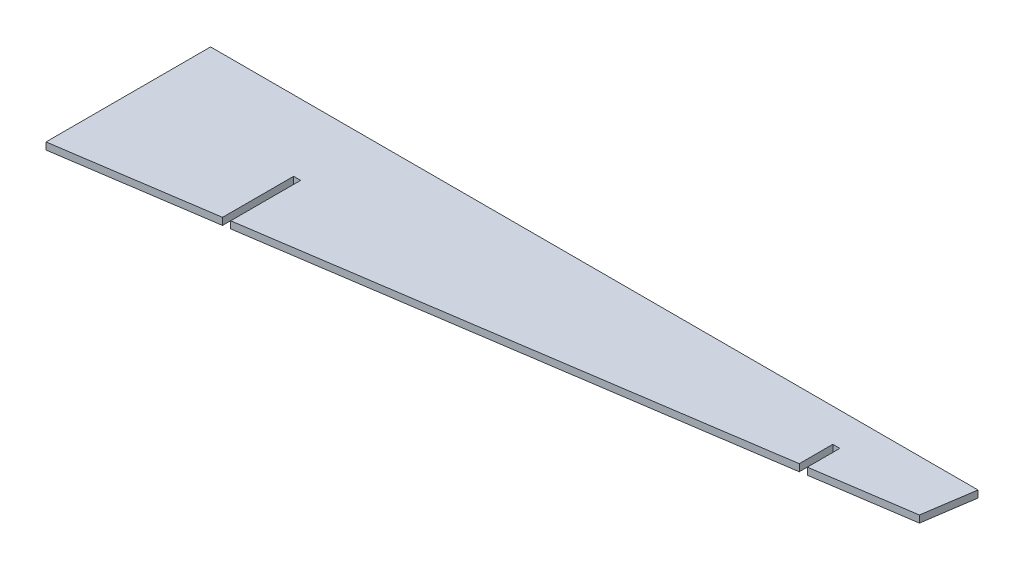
ISO-10303-21;
HEADER;
FILE_DESCRIPTION(('STEP AP214'),'2;1');
FILE_NAME('part.step','',(''),(''),'','','');
FILE_SCHEMA(('AUTOMOTIVE_DESIGN { 1 0 10303 214 1 1 1 1 }'));
ENDSEC;
DATA;
#1=APPLICATION_CONTEXT('core data for automotive mechanical design processes');
#2=APPLICATION_PROTOCOL_DEFINITION('international standard','automotive_design',2000,#1);
#3=PRODUCT_CONTEXT('',#1,'mechanical');
#4=PRODUCT('Part','Part','',(#3));
#5=PRODUCT_RELATED_PRODUCT_CATEGORY('part','',(#4));
#6=PRODUCT_DEFINITION_FORMATION('','',#4);
#7=PRODUCT_DEFINITION_CONTEXT('part definition',#1,'design');
#8=PRODUCT_DEFINITION('design','',#6,#7);
#9=PRODUCT_DEFINITION_SHAPE('','',#8);
#10=(LENGTH_UNIT() NAMED_UNIT(*) SI_UNIT(.MILLI.,.METRE.));
#11=(NAMED_UNIT(*) PLANE_ANGLE_UNIT() SI_UNIT($,.RADIAN.));
#12=(NAMED_UNIT(*) SI_UNIT($,.STERADIAN.) SOLID_ANGLE_UNIT());
#13=UNCERTAINTY_MEASURE_WITH_UNIT(LENGTH_MEASURE(1.E-05),#10,'distance_accuracy_value','');
#14=(GEOMETRIC_REPRESENTATION_CONTEXT(3) GLOBAL_UNCERTAINTY_ASSIGNED_CONTEXT((#13)) GLOBAL_UNIT_ASSIGNED_CONTEXT((#10,
#11,#12)) REPRESENTATION_CONTEXT('',''));
#15=CARTESIAN_POINT('',(0.,0.,0.));
#16=DIRECTION('',(0.,0.,1.));
#17=DIRECTION('',(1.,0.,0.));
#18=AXIS2_PLACEMENT_3D('',#15,#16,#17);
#19=CARTESIAN_POINT('',(984.716974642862,-825.896874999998,57.5474232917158));
#20=DIRECTION('',(-0.147902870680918,0.,-0.989001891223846));
#21=DIRECTION('',(-0.989001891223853,0.,0.147902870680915));
#22=AXIS2_PLACEMENT_3D('',#19,#20,#21);
#23=PLANE('',#22);
#24=DIRECTION('',(0.989001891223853,0.,-0.147902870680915));
#25=VECTOR('',#24,1.);
#26=CARTESIAN_POINT('',(-128.795659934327,-825.896874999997,224.07057825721));
#27=LINE('',#26,#25);
#28=CARTESIAN_POINT('',(203.596875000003,-825.896874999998,174.362068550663));
#29=VERTEX_POINT('',#28);
#30=CARTESIAN_POINT('',(817.165625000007,-825.896874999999,82.6043274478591));
#31=VERTEX_POINT('',#30);
#32=EDGE_CURVE('E42',#29,#31,#27,.T.);
#33=ORIENTED_EDGE('',*,*,#32,.T.);
#34=DIRECTION('',(0.,0.999999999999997,0.));
#35=VECTOR('',#34,1.);
#36=CARTESIAN_POINT('',(817.165625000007,-825.896874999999,82.6043274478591));
#37=LINE('',#36,#35);
#38=CARTESIAN_POINT('',(817.165625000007,-817.165624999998,82.6043274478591));
#39=VERTEX_POINT('',#38);
#40=EDGE_CURVE('E198',#31,#39,#37,.T.);
#41=ORIENTED_EDGE('',*,*,#40,.T.);
#42=DIRECTION('',(-0.989001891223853,0.,0.147902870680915));
#43=VECTOR('',#42,1.);
#44=CARTESIAN_POINT('',(984.716974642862,-817.165624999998,57.5474232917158));
#45=LINE('',#44,#43);
#46=CARTESIAN_POINT('',(203.596875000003,-817.165624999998,174.362068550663));
#47=VERTEX_POINT('',#46);
#48=EDGE_CURVE('E169',#39,#47,#45,.T.);
#49=ORIENTED_EDGE('',*,*,#48,.T.);
#50=DIRECTION('',(0.,0.999999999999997,0.));
#51=VECTOR('',#50,1.);
#52=CARTESIAN_POINT('',(203.596875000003,-825.896874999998,174.362068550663));
#53=LINE('',#52,#51);
#54=EDGE_CURVE('E180',#29,#47,#53,.T.);
#55=ORIENTED_EDGE('',*,*,#54,.F.);
#56=EDGE_LOOP('',(#33,#41,#49,#55));
#57=FACE_BOUND('',#56,.T.);
#58=ADVANCED_FACE('F33',(#57),#23,.F.);
#59=CARTESIAN_POINT('',(4.36562500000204,-825.896874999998,204.156626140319));
#60=VERTEX_POINT('',#59);
#61=CARTESIAN_POINT('',(194.865625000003,-825.896874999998,175.667806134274));
#62=VERTEX_POINT('',#61);
#63=EDGE_CURVE('E12',#60,#62,#27,.T.);
#64=ORIENTED_EDGE('',*,*,#63,.T.);
#65=DIRECTION('',(0.,0.999999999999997,0.));
#66=VECTOR('',#65,1.);
#67=CARTESIAN_POINT('',(194.865625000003,-825.896874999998,175.667806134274));
#68=LINE('',#67,#66);
#69=CARTESIAN_POINT('',(194.865625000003,-817.165624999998,175.667806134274));
#70=VERTEX_POINT('',#69);
#71=EDGE_CURVE('E178',#62,#70,#68,.T.);
#72=ORIENTED_EDGE('',*,*,#71,.T.);
#73=CARTESIAN_POINT('',(4.36562500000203,-817.165624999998,204.156626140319));
#74=VERTEX_POINT('',#73);
#75=EDGE_CURVE('E170',#70,#74,#45,.T.);
#76=ORIENTED_EDGE('',*,*,#75,.T.);
#77=DIRECTION('',(0.,-0.999999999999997,0.));
#78=VECTOR('',#77,1.);
#79=CARTESIAN_POINT('',(4.36562500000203,-825.896874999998,204.156626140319));
#80=LINE('',#79,#78);
#81=EDGE_CURVE('E167',#74,#60,#80,.T.);
#82=ORIENTED_EDGE('',*,*,#81,.T.);
#83=EDGE_LOOP('',(#64,#72,#76,#82));
#84=FACE_BOUND('',#83,.T.);
#85=ADVANCED_FACE('F246',(#84),#23,.F.);
#86=CARTESIAN_POINT('',(4.36562500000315,-825.896874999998,1114.49793799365));
#87=DIRECTION('',(1.00000000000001,0.,0.));
#88=DIRECTION('',(0.,0.,-1.));
#89=AXIS2_PLACEMENT_3D('',#86,#87,#88);
#90=PLANE('',#89);
#91=DIRECTION('',(0.,0.,-1.));
#92=VECTOR('',#91,1.);
#93=CARTESIAN_POINT('',(4.36562500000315,-825.896874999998,1114.49793799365));
#94=LINE('',#93,#92);
#95=CARTESIAN_POINT('',(4.36562500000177,-825.896874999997,0.));
#96=VERTEX_POINT('',#95);
#97=EDGE_CURVE('E155',#60,#96,#94,.T.);
#98=ORIENTED_EDGE('',*,*,#97,.F.);
#99=ORIENTED_EDGE('',*,*,#81,.F.);
#100=DIRECTION('',(0.,0.,-1.));
#101=VECTOR('',#100,1.);
#102=CARTESIAN_POINT('',(4.36562500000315,-817.165624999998,1114.49793799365));
#103=LINE('',#102,#101);
#104=CARTESIAN_POINT('',(4.36562500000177,-817.165624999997,0.));
#105=VERTEX_POINT('',#104);
#106=EDGE_CURVE('E37',#74,#105,#103,.T.);
#107=ORIENTED_EDGE('',*,*,#106,.T.);
#108=DIRECTION('',(0.,-0.999999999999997,0.));
#109=VECTOR('',#108,1.);
#110=CARTESIAN_POINT('',(4.36562500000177,-825.896874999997,0.));
#111=LINE('',#110,#109);
#112=EDGE_CURVE('E151',#105,#96,#111,.T.);
#113=ORIENTED_EDGE('',*,*,#112,.T.);
#114=EDGE_LOOP('',(#98,#99,#107,#113));
#115=FACE_BOUND('',#114,.T.);
#116=ADVANCED_FACE('F35',(#115),#90,.F.);
#117=CARTESIAN_POINT('',(4.36562500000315,-825.896874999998,1114.49793799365));
#118=DIRECTION('',(0.,0.999999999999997,0.));
#119=DIRECTION('',(0.,0.,1.));
#120=AXIS2_PLACEMENT_3D('',#117,#118,#119);
#121=PLANE('',#120);
#122=DIRECTION('',(1.00000000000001,0.,0.));
#123=VECTOR('',#122,1.);
#124=CARTESIAN_POINT('',(4.36562500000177,-825.896874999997,0.));
#125=LINE('',#124,#123);
#126=CARTESIAN_POINT('',(956.248498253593,-825.896874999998,0.));
#127=VERTEX_POINT('',#126);
#128=EDGE_CURVE('E152',#96,#127,#125,.T.);
#129=ORIENTED_EDGE('',*,*,#128,.T.);
#130=DIRECTION('',(-0.147902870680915,0.,0.989001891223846));
#131=VECTOR('',#130,1.);
#132=CARTESIAN_POINT('',(772.401269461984,-825.896874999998,1229.35583423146));
#133=LINE('',#132,#131);
#134=CARTESIAN_POINT('',(946.794297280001,-825.896874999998,63.2186691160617));
#135=VERTEX_POINT('',#134);
#136=EDGE_CURVE('E132',#127,#135,#133,.T.);
#137=ORIENTED_EDGE('',*,*,#136,.T.);
#138=CARTESIAN_POINT('',(825.896875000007,-825.896874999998,81.2985898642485));
#139=VERTEX_POINT('',#138);
#140=EDGE_CURVE('E44',#139,#135,#27,.T.);
#141=ORIENTED_EDGE('',*,*,#140,.F.);
#142=DIRECTION('',(0.,0.,-1.));
#143=VECTOR('',#142,1.);
#144=CARTESIAN_POINT('',(825.896875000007,-825.896874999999,40.9757293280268));
#145=LINE('',#144,#143);
#146=CARTESIAN_POINT('',(825.896875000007,-825.896874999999,40.9757293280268));
#147=VERTEX_POINT('',#146);
#148=EDGE_CURVE('E51',#139,#147,#145,.T.);
#149=ORIENTED_EDGE('',*,*,#148,.T.);
#150=DIRECTION('',(-1.00000000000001,0.,0.));
#151=VECTOR('',#150,1.);
#152=CARTESIAN_POINT('',(817.165625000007,-825.896874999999,40.9757293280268));
#153=LINE('',#152,#151);
#154=CARTESIAN_POINT('',(817.165625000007,-825.896874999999,40.9757293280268));
#155=VERTEX_POINT('',#154);
#156=EDGE_CURVE('E202',#147,#155,#153,.T.);
#157=ORIENTED_EDGE('',*,*,#156,.T.);
#158=DIRECTION('',(0.,0.,1.));
#159=VECTOR('',#158,1.);
#160=CARTESIAN_POINT('',(817.165625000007,-825.896874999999,40.9757293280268));
#161=LINE('',#160,#159);
#162=EDGE_CURVE('E210',#155,#31,#161,.T.);
#163=ORIENTED_EDGE('',*,*,#162,.T.);
#164=ORIENTED_EDGE('',*,*,#32,.F.);
#165=DIRECTION('',(0.,0.,-1.));
#166=VECTOR('',#165,1.);
#167=CARTESIAN_POINT('',(203.596875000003,-825.896874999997,87.5074686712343));
#168=LINE('',#167,#166);
#169=CARTESIAN_POINT('',(203.596875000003,-825.896874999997,87.5074686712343));
#170=VERTEX_POINT('',#169);
#171=EDGE_CURVE('E59',#29,#170,#168,.T.);
#172=ORIENTED_EDGE('',*,*,#171,.T.);
#173=DIRECTION('',(-1.00000000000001,0.,0.));
#174=VECTOR('',#173,1.);
#175=CARTESIAN_POINT('',(194.865625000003,-825.896874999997,87.5074686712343));
#176=LINE('',#175,#174);
#177=CARTESIAN_POINT('',(194.865625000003,-825.896874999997,87.5074686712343));
#178=VERTEX_POINT('',#177);
#179=EDGE_CURVE('E181',#170,#178,#176,.T.);
#180=ORIENTED_EDGE('',*,*,#179,.T.);
#181=DIRECTION('',(0.,0.,1.));
#182=VECTOR('',#181,1.);
#183=CARTESIAN_POINT('',(194.865625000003,-825.896874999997,87.5074686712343));
#184=LINE('',#183,#182);
#185=EDGE_CURVE('E187',#178,#62,#184,.T.);
#186=ORIENTED_EDGE('',*,*,#185,.T.);
#187=ORIENTED_EDGE('',*,*,#63,.F.);
#188=ORIENTED_EDGE('',*,*,#97,.T.);
#189=EDGE_LOOP('',(#129,#137,#141,#149,#157,#163,#164,#172,#180,#186,#187,#188));
#190=FACE_BOUND('',#189,.T.);
#191=ADVANCED_FACE('F163',(#190),#121,.F.);
#192=CARTESIAN_POINT('',(4.36562500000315,-817.165624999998,1114.49793799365));
#193=DIRECTION('',(0.,-0.999999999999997,0.));
#194=DIRECTION('',(1.00000000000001,0.,0.));
#195=AXIS2_PLACEMENT_3D('',#192,#193,#194);
#196=PLANE('',#195);
#197=CARTESIAN_POINT('',(946.794297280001,-817.165624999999,63.2186691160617));
#198=VERTEX_POINT('',#197);
#199=CARTESIAN_POINT('',(825.896875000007,-817.165624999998,81.2985898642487));
#200=VERTEX_POINT('',#199);
#201=EDGE_CURVE('E145',#198,#200,#45,.T.);
#202=ORIENTED_EDGE('',*,*,#201,.F.);
#203=DIRECTION('',(0.147902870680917,0.,-0.989001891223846));
#204=VECTOR('',#203,1.);
#205=CARTESIAN_POINT('',(905.533991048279,-817.165624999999,339.119472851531));
#206=LINE('',#205,#204);
#207=CARTESIAN_POINT('',(956.248498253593,-817.165624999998,0.));
#208=VERTEX_POINT('',#207);
#209=EDGE_CURVE('E129',#198,#208,#206,.T.);
#210=ORIENTED_EDGE('',*,*,#209,.T.);
#211=DIRECTION('',(-1.00000000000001,0.,0.));
#212=VECTOR('',#211,1.);
#213=CARTESIAN_POINT('',(4.36562500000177,-817.165624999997,0.));
#214=LINE('',#213,#212);
#215=EDGE_CURVE('E142',#208,#105,#214,.T.);
#216=ORIENTED_EDGE('',*,*,#215,.T.);
#217=ORIENTED_EDGE('',*,*,#106,.F.);
#218=ORIENTED_EDGE('',*,*,#75,.F.);
#219=DIRECTION('',(0.,0.,1.));
#220=VECTOR('',#219,1.);
#221=CARTESIAN_POINT('',(194.865625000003,-817.165624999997,87.5074686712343));
#222=LINE('',#221,#220);
#223=CARTESIAN_POINT('',(194.865625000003,-817.165624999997,87.5074686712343));
#224=VERTEX_POINT('',#223);
#225=EDGE_CURVE('E191',#224,#70,#222,.T.);
#226=ORIENTED_EDGE('',*,*,#225,.F.);
#227=DIRECTION('',(-1.00000000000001,0.,0.));
#228=VECTOR('',#227,1.);
#229=CARTESIAN_POINT('',(194.865625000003,-817.165624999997,87.5074686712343));
#230=LINE('',#229,#228);
#231=CARTESIAN_POINT('',(203.596875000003,-817.165624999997,87.5074686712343));
#232=VERTEX_POINT('',#231);
#233=EDGE_CURVE('E184',#232,#224,#230,.T.);
#234=ORIENTED_EDGE('',*,*,#233,.F.);
#235=DIRECTION('',(0.,0.,-1.));
#236=VECTOR('',#235,1.);
#237=CARTESIAN_POINT('',(203.596875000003,-817.165624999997,87.5074686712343));
#238=LINE('',#237,#236);
#239=EDGE_CURVE('E188',#47,#232,#238,.T.);
#240=ORIENTED_EDGE('',*,*,#239,.F.);
#241=ORIENTED_EDGE('',*,*,#48,.F.);
#242=DIRECTION('',(0.,0.,1.));
#243=VECTOR('',#242,1.);
#244=CARTESIAN_POINT('',(817.165625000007,-817.165624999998,40.9757293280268));
#245=LINE('',#244,#243);
#246=CARTESIAN_POINT('',(817.165625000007,-817.165624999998,40.9757293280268));
#247=VERTEX_POINT('',#246);
#248=EDGE_CURVE('E214',#247,#39,#245,.T.);
#249=ORIENTED_EDGE('',*,*,#248,.F.);
#250=DIRECTION('',(-1.00000000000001,0.,0.));
#251=VECTOR('',#250,1.);
#252=CARTESIAN_POINT('',(817.165625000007,-817.165624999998,40.9757293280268));
#253=LINE('',#252,#251);
#254=CARTESIAN_POINT('',(825.896875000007,-817.165624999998,40.9757293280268));
#255=VERTEX_POINT('',#254);
#256=EDGE_CURVE('E207',#255,#247,#253,.T.);
#257=ORIENTED_EDGE('',*,*,#256,.F.);
#258=DIRECTION('',(0.,0.,-1.));
#259=VECTOR('',#258,1.);
#260=CARTESIAN_POINT('',(825.896875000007,-817.165624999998,40.9757293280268));
#261=LINE('',#260,#259);
#262=EDGE_CURVE('E211',#200,#255,#261,.T.);
#263=ORIENTED_EDGE('',*,*,#262,.F.);
#264=EDGE_LOOP('',(#202,#210,#216,#217,#218,#226,#234,#240,#241,#249,#257,#263));
#265=FACE_BOUND('',#264,.T.);
#266=ADVANCED_FACE('F140',(#265),#196,.F.);
#267=CARTESIAN_POINT('',(0.,0.,0.));
#268=DIRECTION('',(0.,0.,-1.));
#269=DIRECTION('',(-1.00000000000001,0.,0.));
#270=AXIS2_PLACEMENT_3D('',#267,#268,#269);
#271=PLANE('',#270);
#272=DIRECTION('',(0.,0.999999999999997,0.));
#273=VECTOR('',#272,1.);
#274=CARTESIAN_POINT('',(956.248498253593,-825.896874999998,0.));
#275=LINE('',#274,#273);
#276=EDGE_CURVE('E126',#127,#208,#275,.T.);
#277=ORIENTED_EDGE('',*,*,#276,.F.);
#278=ORIENTED_EDGE('',*,*,#128,.F.);
#279=ORIENTED_EDGE('',*,*,#112,.F.);
#280=ORIENTED_EDGE('',*,*,#215,.F.);
#281=EDGE_LOOP('',(#277,#278,#279,#280));
#282=FACE_BOUND('',#281,.T.);
#283=ADVANCED_FACE('F149',(#282),#271,.T.);
#284=ORIENTED_EDGE('',*,*,#140,.T.);
#285=DIRECTION('',(0.,0.999999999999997,0.));
#286=VECTOR('',#285,1.);
#287=CARTESIAN_POINT('',(946.794297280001,-825.896874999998,63.2186691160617));
#288=LINE('',#287,#286);
#289=EDGE_CURVE('E146',#135,#198,#288,.T.);
#290=ORIENTED_EDGE('',*,*,#289,.T.);
#291=ORIENTED_EDGE('',*,*,#201,.T.);
#292=DIRECTION('',(0.,0.999999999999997,0.));
#293=VECTOR('',#292,1.);
#294=CARTESIAN_POINT('',(825.896875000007,-825.896874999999,81.2985898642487));
#295=LINE('',#294,#293);
#296=EDGE_CURVE('E201',#139,#200,#295,.T.);
#297=ORIENTED_EDGE('',*,*,#296,.F.);
#298=EDGE_LOOP('',(#284,#290,#291,#297));
#299=FACE_BOUND('',#298,.T.);
#300=ADVANCED_FACE('F222',(#299),#23,.F.);
#301=CARTESIAN_POINT('',(194.865625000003,-825.896874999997,87.5074686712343));
#302=DIRECTION('',(-1.00000000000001,0.,0.));
#303=DIRECTION('',(0.,-0.999999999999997,0.));
#304=AXIS2_PLACEMENT_3D('',#301,#302,#303);
#305=PLANE('',#304);
#306=ORIENTED_EDGE('',*,*,#225,.T.);
#307=ORIENTED_EDGE('',*,*,#71,.F.);
#308=ORIENTED_EDGE('',*,*,#185,.F.);
#309=DIRECTION('',(0.,0.999999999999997,0.));
#310=VECTOR('',#309,1.);
#311=CARTESIAN_POINT('',(194.865625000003,-825.896874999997,87.5074686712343));
#312=LINE('',#311,#310);
#313=EDGE_CURVE('E174',#178,#224,#312,.T.);
#314=ORIENTED_EDGE('',*,*,#313,.T.);
#315=EDGE_LOOP('',(#306,#307,#308,#314));
#316=FACE_BOUND('',#315,.T.);
#317=ADVANCED_FACE('F245',(#316),#305,.F.);
#318=CARTESIAN_POINT('',(194.865625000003,-825.896874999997,87.5074686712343));
#319=DIRECTION('',(0.,0.,-1.));
#320=DIRECTION('',(-1.00000000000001,0.,0.));
#321=AXIS2_PLACEMENT_3D('',#318,#319,#320);
#322=PLANE('',#321);
#323=ORIENTED_EDGE('',*,*,#233,.T.);
#324=ORIENTED_EDGE('',*,*,#313,.F.);
#325=ORIENTED_EDGE('',*,*,#179,.F.);
#326=DIRECTION('',(0.,0.999999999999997,0.));
#327=VECTOR('',#326,1.);
#328=CARTESIAN_POINT('',(203.596875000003,-825.896874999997,87.5074686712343));
#329=LINE('',#328,#327);
#330=EDGE_CURVE('E175',#170,#232,#329,.T.);
#331=ORIENTED_EDGE('',*,*,#330,.T.);
#332=EDGE_LOOP('',(#323,#324,#325,#331));
#333=FACE_BOUND('',#332,.T.);
#334=ADVANCED_FACE('F243',(#333),#322,.F.);
#335=CARTESIAN_POINT('',(203.596875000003,-825.896874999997,87.5074686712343));
#336=DIRECTION('',(1.00000000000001,0.,0.));
#337=DIRECTION('',(0.,0.999999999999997,0.));
#338=AXIS2_PLACEMENT_3D('',#335,#336,#337);
#339=PLANE('',#338);
#340=ORIENTED_EDGE('',*,*,#239,.T.);
#341=ORIENTED_EDGE('',*,*,#330,.F.);
#342=ORIENTED_EDGE('',*,*,#171,.F.);
#343=ORIENTED_EDGE('',*,*,#54,.T.);
#344=EDGE_LOOP('',(#340,#341,#342,#343));
#345=FACE_BOUND('',#344,.T.);
#346=ADVANCED_FACE('F239',(#345),#339,.F.);
#347=CARTESIAN_POINT('',(817.165625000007,-825.896874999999,40.9757293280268));
#348=DIRECTION('',(-1.00000000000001,0.,0.));
#349=DIRECTION('',(0.,-0.999999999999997,0.));
#350=AXIS2_PLACEMENT_3D('',#347,#348,#349);
#351=PLANE('',#350);
#352=ORIENTED_EDGE('',*,*,#248,.T.);
#353=ORIENTED_EDGE('',*,*,#40,.F.);
#354=ORIENTED_EDGE('',*,*,#162,.F.);
#355=DIRECTION('',(0.,0.999999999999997,0.));
#356=VECTOR('',#355,1.);
#357=CARTESIAN_POINT('',(817.165625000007,-825.896874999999,40.9757293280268));
#358=LINE('',#357,#356);
#359=EDGE_CURVE('E193',#155,#247,#358,.T.);
#360=ORIENTED_EDGE('',*,*,#359,.T.);
#361=EDGE_LOOP('',(#352,#353,#354,#360));
#362=FACE_BOUND('',#361,.T.);
#363=ADVANCED_FACE('F233',(#362),#351,.F.);
#364=CARTESIAN_POINT('',(817.165625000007,-825.896874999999,40.9757293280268));
#365=DIRECTION('',(0.,0.,-1.));
#366=DIRECTION('',(-1.00000000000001,0.,0.));
#367=AXIS2_PLACEMENT_3D('',#364,#365,#366);
#368=PLANE('',#367);
#369=ORIENTED_EDGE('',*,*,#256,.T.);
#370=ORIENTED_EDGE('',*,*,#359,.F.);
#371=ORIENTED_EDGE('',*,*,#156,.F.);
#372=DIRECTION('',(0.,0.999999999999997,0.));
#373=VECTOR('',#372,1.);
#374=CARTESIAN_POINT('',(825.896875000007,-825.896874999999,40.9757293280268));
#375=LINE('',#374,#373);
#376=EDGE_CURVE('E204',#147,#255,#375,.T.);
#377=ORIENTED_EDGE('',*,*,#376,.T.);
#378=EDGE_LOOP('',(#369,#370,#371,#377));
#379=FACE_BOUND('',#378,.T.);
#380=ADVANCED_FACE('F229',(#379),#368,.F.);
#381=CARTESIAN_POINT('',(825.896875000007,-825.896874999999,40.9757293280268));
#382=DIRECTION('',(1.00000000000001,0.,0.));
#383=DIRECTION('',(0.,0.999999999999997,0.));
#384=AXIS2_PLACEMENT_3D('',#381,#382,#383);
#385=PLANE('',#384);
#386=ORIENTED_EDGE('',*,*,#262,.T.);
#387=ORIENTED_EDGE('',*,*,#376,.F.);
#388=ORIENTED_EDGE('',*,*,#148,.F.);
#389=ORIENTED_EDGE('',*,*,#296,.T.);
#390=EDGE_LOOP('',(#386,#387,#388,#389));
#391=FACE_BOUND('',#390,.T.);
#392=ADVANCED_FACE('F312',(#391),#385,.F.);
#393=CARTESIAN_POINT('',(905.533991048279,-825.896874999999,339.119472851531));
#394=DIRECTION('',(-0.989001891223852,0.,-0.147902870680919));
#395=DIRECTION('',(-0.147902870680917,0.,0.989001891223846));
#396=AXIS2_PLACEMENT_3D('',#393,#394,#395);
#397=PLANE('',#396);
#398=ORIENTED_EDGE('',*,*,#136,.F.);
#399=ORIENTED_EDGE('',*,*,#276,.T.);
#400=ORIENTED_EDGE('',*,*,#209,.F.);
#401=ORIENTED_EDGE('',*,*,#289,.F.);
#402=EDGE_LOOP('',(#398,#399,#400,#401));
#403=FACE_BOUND('',#402,.T.);
#404=ADVANCED_FACE('F128',(#403),#397,.F.);
#405=CLOSED_SHELL('',(#58,#85,#116,#191,#266,#283,#300,#317,#334,#346,#363,#380,#392,#404));
#406=MANIFOLD_SOLID_BREP('B2',#405);
#407=ADVANCED_BREP_SHAPE_REPRESENTATION('',(#18,#406),#14);
#408=SHAPE_DEFINITION_REPRESENTATION(#9,#407);
ENDSEC;
END-ISO-10303-21;
